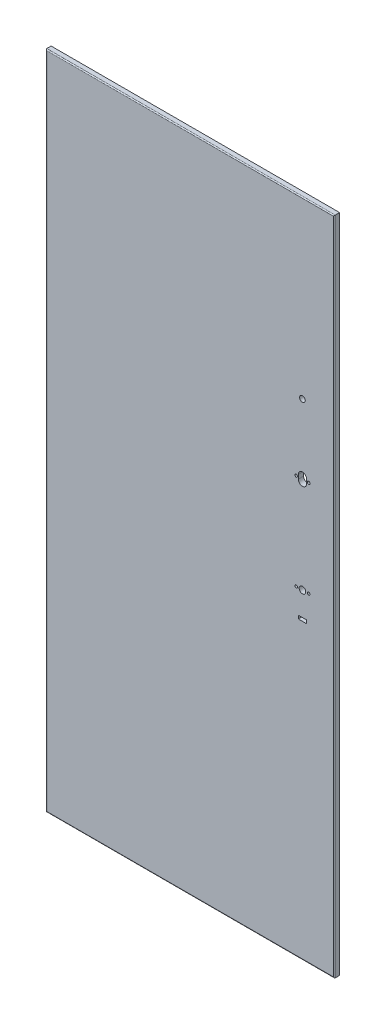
from build123d import *

# Parameters (mm, degrees)
SKETCH_1_W               = 872
SKETCH_1_H               = 1997
EXTRUDE_1_DEPTH          = 16
CUT_EXTRUDE_1_DEPTH      = 1090.657859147
CUT_EXTRUDE_1_DEPTH_BACK = 1090.657859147
SKETCH_2_W               = 25
SKETCH_2_H               = 10
SKETCH_2_R               = 8.5
SKETCH_2_R_2             = 10
SKETCH_2_R_3             = 4
SKETCH_2_R_4             = 4.1
FILLET_1_R               = 3


with BuildPart() as part:
    # Sketch 1 → Extrude 1 (new body)
    with BuildSketch(Plane.XY):
        Rectangle(SKETCH_1_W, SKETCH_1_H)
    extrude(amount=EXTRUDE_1_DEPTH)

    # Sketch 2 → Cut-Extrude 1 (cut, two sides: drawn at the far end of the back side and taken through both)
    with BuildSketch(Plane.XY.offset(-CUT_EXTRUDE_1_DEPTH_BACK)):
        with Locations((339.7, -106.8)):
            Rectangle(SKETCH_2_W, SKETCH_2_H)
        with BuildLine():
            ThreePointArc((327.2, 254.15), (339.7, 241.65), (352.2, 254.15))
            Line((352.2, 254.15), (352.2, 266.65))
            ThreePointArc((352.2, 266.65), (339.7, 279.15), (327.2, 266.65))
            Line((327.2, 266.65), (327.2, 254.15))
        make_face()
        with Locations((339.7, 470.2)):
            Circle(SKETCH_2_R)
        with Locations((339.7, -29.8)):
            Circle(SKETCH_2_R_2)
        with Locations((358.7, -29.8)):
            Circle(SKETCH_2_R_3)
        with Locations((320.7, -29.8)):
            Circle(SKETCH_2_R_3)
        with Locations((358.7, 260.4)):
            Circle(SKETCH_2_R_4)
        with Locations((320.7, 260.4)):
            Circle(SKETCH_2_R_4)
    extrude(amount=CUT_EXTRUDE_1_DEPTH + CUT_EXTRUDE_1_DEPTH_BACK, mode=Mode.SUBTRACT)

    # Fillet 1
    fillet_1_edges = [part.edges().sort_by_distance(p)[0] for p in [
        (436, 0, 16),
        (0, 998.5, 16),
        (-436, 0, 16),
        (0, -998.5, 16),
    ]]
    fillet(fillet_1_edges, radius=FILLET_1_R)


solid = part.part
